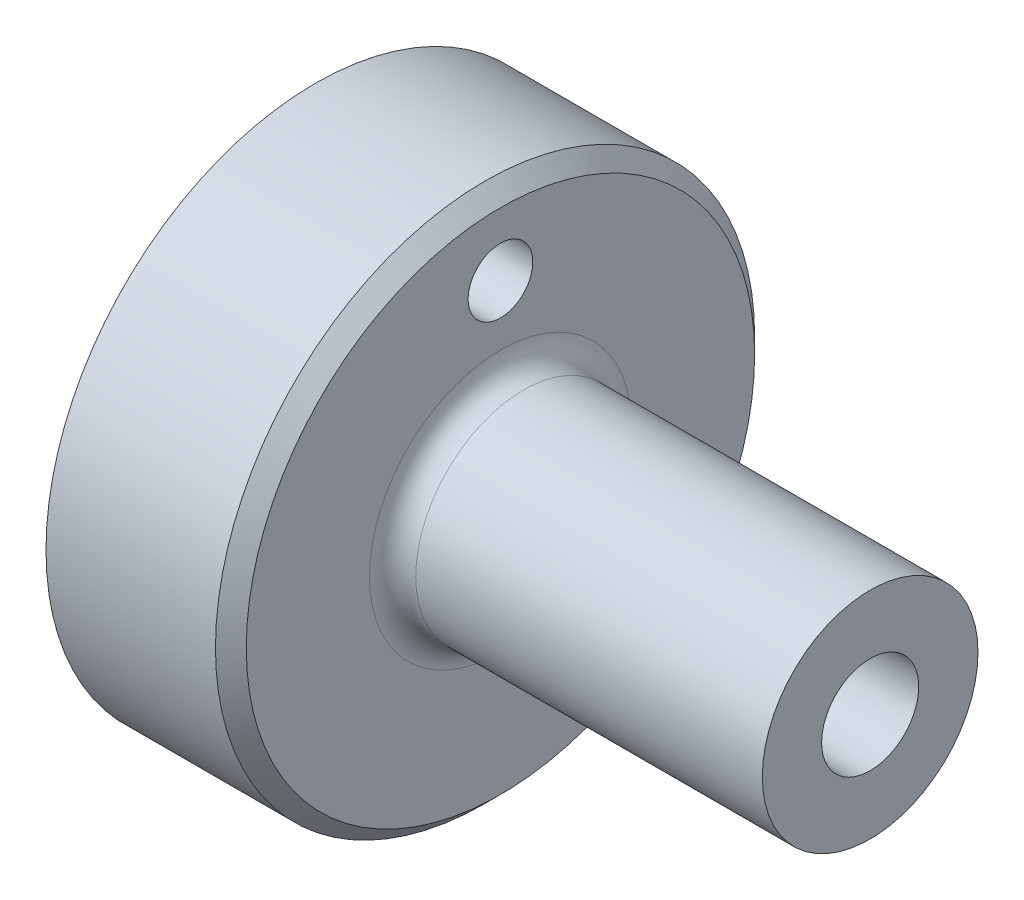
ISO-10303-21;
HEADER;
FILE_DESCRIPTION(('STEP AP214'),'2;1');
FILE_NAME('part.step','',(''),(''),'','','');
FILE_SCHEMA(('AUTOMOTIVE_DESIGN { 1 0 10303 214 1 1 1 1 }'));
ENDSEC;
DATA;
#1=APPLICATION_CONTEXT('core data for automotive mechanical design processes');
#2=APPLICATION_PROTOCOL_DEFINITION('international standard','automotive_design',2000,#1);
#3=PRODUCT_CONTEXT('',#1,'mechanical');
#4=PRODUCT('Part','Part','',(#3));
#5=PRODUCT_RELATED_PRODUCT_CATEGORY('part','',(#4));
#6=PRODUCT_DEFINITION_FORMATION('','',#4);
#7=PRODUCT_DEFINITION_CONTEXT('part definition',#1,'design');
#8=PRODUCT_DEFINITION('design','',#6,#7);
#9=PRODUCT_DEFINITION_SHAPE('','',#8);
#10=(LENGTH_UNIT() NAMED_UNIT(*) SI_UNIT(.MILLI.,.METRE.));
#11=(NAMED_UNIT(*) PLANE_ANGLE_UNIT() SI_UNIT($,.RADIAN.));
#12=(NAMED_UNIT(*) SI_UNIT($,.STERADIAN.) SOLID_ANGLE_UNIT());
#13=UNCERTAINTY_MEASURE_WITH_UNIT(LENGTH_MEASURE(1.E-05),#10,'distance_accuracy_value','');
#14=(GEOMETRIC_REPRESENTATION_CONTEXT(3) GLOBAL_UNCERTAINTY_ASSIGNED_CONTEXT((#13)) GLOBAL_UNIT_ASSIGNED_CONTEXT((#10,
#11,#12)) REPRESENTATION_CONTEXT('',''));
#15=CARTESIAN_POINT('',(0.,0.,0.));
#16=DIRECTION('',(0.,0.,1.));
#17=DIRECTION('',(1.,0.,0.));
#18=AXIS2_PLACEMENT_3D('',#15,#16,#17);
#19=CARTESIAN_POINT('',(13.5,0.,0.));
#20=DIRECTION('',(-1.,0.,0.));
#21=DIRECTION('',(0.,0.,1.));
#22=AXIS2_PLACEMENT_3D('',#19,#20,#21);
#23=TOROIDAL_SURFACE('',#22,8.5,1.5);
#24=CARTESIAN_POINT('',(12.,0.,0.));
#25=DIRECTION('',(-1.,0.,0.));
#26=DIRECTION('',(0.,0.,1.));
#27=AXIS2_PLACEMENT_3D('',#24,#25,#26);
#28=CIRCLE('',#27,8.5);
#29=CARTESIAN_POINT('',(12.,0.,8.5));
#30=VERTEX_POINT('',#29);
#31=EDGE_CURVE('E29',#30,#30,#28,.T.);
#32=ORIENTED_EDGE('',*,*,#31,.F.);
#33=EDGE_LOOP('',(#32));
#34=FACE_BOUND('',#33,.T.);
#35=CARTESIAN_POINT('',(13.5,0.,0.));
#36=DIRECTION('',(-1.,0.,0.));
#37=DIRECTION('',(0.,0.,1.));
#38=AXIS2_PLACEMENT_3D('',#35,#36,#37);
#39=CIRCLE('',#38,7.);
#40=CARTESIAN_POINT('',(13.5,0.,7.));
#41=VERTEX_POINT('',#40);
#42=EDGE_CURVE('E63',#41,#41,#39,.T.);
#43=ORIENTED_EDGE('',*,*,#42,.T.);
#44=EDGE_LOOP('',(#43));
#45=FACE_BOUND('',#44,.T.);
#46=ADVANCED_FACE('F13',(#34,#45),#23,.F.);
#47=CARTESIAN_POINT('',(12.,17.5,0.));
#48=DIRECTION('',(-1.,0.,0.));
#49=DIRECTION('',(0.,0.,1.));
#50=AXIS2_PLACEMENT_3D('',#47,#48,#49);
#51=PLANE('',#50);
#52=CARTESIAN_POINT('',(12.,0.,0.));
#53=DIRECTION('',(-1.,0.,0.));
#54=DIRECTION('',(0.,0.,1.));
#55=AXIS2_PLACEMENT_3D('',#52,#53,#54);
#56=CIRCLE('',#55,16.5);
#57=CARTESIAN_POINT('',(12.,0.,16.5));
#58=VERTEX_POINT('',#57);
#59=EDGE_CURVE('E8',#58,#58,#56,.F.);
#60=ORIENTED_EDGE('',*,*,#59,.T.);
#61=EDGE_LOOP('',(#60));
#62=FACE_BOUND('',#61,.T.);
#63=CARTESIAN_POINT('',(12.,12.4,0.));
#64=DIRECTION('',(-1.,0.,0.));
#65=DIRECTION('',(0.,0.,1.));
#66=AXIS2_PLACEMENT_3D('',#63,#64,#65);
#67=CIRCLE('',#66,2.1);
#68=CARTESIAN_POINT('',(12.,12.4,2.1));
#69=VERTEX_POINT('',#68);
#70=EDGE_CURVE('E39',#69,#69,#67,.T.);
#71=ORIENTED_EDGE('',*,*,#70,.T.);
#72=EDGE_LOOP('',(#71));
#73=FACE_BOUND('',#72,.T.);
#74=ORIENTED_EDGE('',*,*,#31,.T.);
#75=EDGE_LOOP('',(#74));
#76=FACE_BOUND('',#75,.T.);
#77=ADVANCED_FACE('F102',(#62,#73,#76),#51,.F.);
#78=CARTESIAN_POINT('',(0.,0.,0.));
#79=DIRECTION('',(-1.,0.,0.));
#80=DIRECTION('',(0.,0.,1.));
#81=AXIS2_PLACEMENT_3D('',#78,#79,#80);
#82=CYLINDRICAL_SURFACE('',#81,17.5);
#83=CARTESIAN_POINT('',(11.,0.,0.));
#84=DIRECTION('',(-1.,0.,0.));
#85=DIRECTION('',(0.,0.,1.));
#86=AXIS2_PLACEMENT_3D('',#83,#84,#85);
#87=CIRCLE('',#86,17.5);
#88=CARTESIAN_POINT('',(11.,0.,17.5));
#89=VERTEX_POINT('',#88);
#90=EDGE_CURVE('E21',#89,#89,#87,.T.);
#91=ORIENTED_EDGE('',*,*,#90,.T.);
#92=EDGE_LOOP('',(#91));
#93=FACE_BOUND('',#92,.T.);
#94=CARTESIAN_POINT('',(0.,0.,0.));
#95=DIRECTION('',(-1.,0.,0.));
#96=DIRECTION('',(0.,0.,1.));
#97=AXIS2_PLACEMENT_3D('',#94,#95,#96);
#98=CIRCLE('',#97,17.5);
#99=CARTESIAN_POINT('',(0.,0.,17.5));
#100=VERTEX_POINT('',#99);
#101=EDGE_CURVE('E36',#100,#100,#98,.T.);
#102=ORIENTED_EDGE('',*,*,#101,.F.);
#103=EDGE_LOOP('',(#102));
#104=FACE_BOUND('',#103,.T.);
#105=ADVANCED_FACE('F95',(#93,#104),#82,.T.);
#106=CARTESIAN_POINT('',(0.,4.10062261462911,0.));
#107=DIRECTION('',(1.,0.,0.));
#108=DIRECTION('',(0.,0.,-1.));
#109=AXIS2_PLACEMENT_3D('',#106,#107,#108);
#110=PLANE('',#109);
#111=CARTESIAN_POINT('',(0.,12.4,0.));
#112=DIRECTION('',(-1.,0.,0.));
#113=DIRECTION('',(0.,0.,1.));
#114=AXIS2_PLACEMENT_3D('',#111,#112,#113);
#115=CIRCLE('',#114,3.6);
#116=CARTESIAN_POINT('',(0.,12.4,3.6));
#117=VERTEX_POINT('',#116);
#118=EDGE_CURVE('E42',#117,#117,#115,.T.);
#119=ORIENTED_EDGE('',*,*,#118,.F.);
#120=EDGE_LOOP('',(#119));
#121=FACE_BOUND('',#120,.T.);
#122=CARTESIAN_POINT('',(0.,0.,0.));
#123=DIRECTION('',(-1.,0.,0.));
#124=DIRECTION('',(0.,0.,1.));
#125=AXIS2_PLACEMENT_3D('',#122,#123,#124);
#126=CIRCLE('',#125,4.10062261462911);
#127=CARTESIAN_POINT('',(0.,0.,4.10062261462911));
#128=VERTEX_POINT('',#127);
#129=EDGE_CURVE('E48',#128,#128,#126,.T.);
#130=ORIENTED_EDGE('',*,*,#129,.F.);
#131=EDGE_LOOP('',(#130));
#132=FACE_BOUND('',#131,.T.);
#133=ORIENTED_EDGE('',*,*,#101,.T.);
#134=EDGE_LOOP('',(#133));
#135=FACE_BOUND('',#134,.T.);
#136=ADVANCED_FACE('F91',(#121,#132,#135),#110,.F.);
#137=CARTESIAN_POINT('',(0.,0.,0.));
#138=DIRECTION('',(-1.,0.,0.));
#139=DIRECTION('',(0.,0.,1.));
#140=AXIS2_PLACEMENT_3D('',#137,#138,#139);
#141=CONICAL_SURFACE('',#140,4.10062261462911,0.610865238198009);
#142=CARTESIAN_POINT('',(3.,0.,0.));
#143=DIRECTION('',(-1.,0.,0.));
#144=DIRECTION('',(0.,0.,1.));
#145=AXIS2_PLACEMENT_3D('',#142,#143,#144);
#146=CIRCLE('',#145,2.);
#147=CARTESIAN_POINT('',(3.,0.,2.));
#148=VERTEX_POINT('',#147);
#149=EDGE_CURVE('E52',#148,#148,#146,.T.);
#150=ORIENTED_EDGE('',*,*,#149,.F.);
#151=EDGE_LOOP('',(#150));
#152=FACE_BOUND('',#151,.T.);
#153=ORIENTED_EDGE('',*,*,#129,.T.);
#154=EDGE_LOOP('',(#153));
#155=FACE_BOUND('',#154,.T.);
#156=ADVANCED_FACE('F94',(#152,#155),#141,.F.);
#157=CARTESIAN_POINT('',(3.,0.,0.));
#158=DIRECTION('',(1.,0.,0.));
#159=DIRECTION('',(0.,0.,-1.));
#160=AXIS2_PLACEMENT_3D('',#157,#158,#159);
#161=CONICAL_SURFACE('',#160,2.,0.0349065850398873);
#162=CARTESIAN_POINT('',(36.,0.,0.));
#163=DIRECTION('',(-1.,0.,0.));
#164=DIRECTION('',(0.,0.,1.));
#165=AXIS2_PLACEMENT_3D('',#162,#163,#164);
#166=CIRCLE('',#165,3.1523853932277);
#167=CARTESIAN_POINT('',(36.,0.,3.1523853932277));
#168=VERTEX_POINT('',#167);
#169=EDGE_CURVE('E55',#168,#168,#166,.T.);
#170=ORIENTED_EDGE('',*,*,#169,.F.);
#171=EDGE_LOOP('',(#170));
#172=FACE_BOUND('',#171,.T.);
#173=ORIENTED_EDGE('',*,*,#149,.T.);
#174=EDGE_LOOP('',(#173));
#175=FACE_BOUND('',#174,.T.);
#176=ADVANCED_FACE('F123',(#172,#175),#161,.F.);
#177=CARTESIAN_POINT('',(36.,7.,0.));
#178=DIRECTION('',(-1.,0.,0.));
#179=DIRECTION('',(0.,0.,1.));
#180=AXIS2_PLACEMENT_3D('',#177,#178,#179);
#181=PLANE('',#180);
#182=CARTESIAN_POINT('',(36.,0.,0.));
#183=DIRECTION('',(-1.,0.,0.));
#184=DIRECTION('',(0.,0.,1.));
#185=AXIS2_PLACEMENT_3D('',#182,#183,#184);
#186=CIRCLE('',#185,7.);
#187=CARTESIAN_POINT('',(36.,0.,7.));
#188=VERTEX_POINT('',#187);
#189=EDGE_CURVE('E59',#188,#188,#186,.T.);
#190=ORIENTED_EDGE('',*,*,#189,.F.);
#191=EDGE_LOOP('',(#190));
#192=FACE_BOUND('',#191,.T.);
#193=ORIENTED_EDGE('',*,*,#169,.T.);
#194=EDGE_LOOP('',(#193));
#195=FACE_BOUND('',#194,.T.);
#196=ADVANCED_FACE('F117',(#192,#195),#181,.F.);
#197=CARTESIAN_POINT('',(0.,0.,0.));
#198=DIRECTION('',(-1.,0.,0.));
#199=DIRECTION('',(0.,0.,1.));
#200=AXIS2_PLACEMENT_3D('',#197,#198,#199);
#201=CYLINDRICAL_SURFACE('',#200,7.);
#202=ORIENTED_EDGE('',*,*,#42,.F.);
#203=EDGE_LOOP('',(#202));
#204=FACE_BOUND('',#203,.T.);
#205=ORIENTED_EDGE('',*,*,#189,.T.);
#206=EDGE_LOOP('',(#205));
#207=FACE_BOUND('',#206,.T.);
#208=ADVANCED_FACE('F87',(#204,#207),#201,.T.);
#209=CARTESIAN_POINT('',(5.,12.4,0.));
#210=DIRECTION('',(-1.,0.,0.));
#211=DIRECTION('',(0.,0.,1.));
#212=AXIS2_PLACEMENT_3D('',#209,#210,#211);
#213=CYLINDRICAL_SURFACE('',#212,3.6);
#214=CARTESIAN_POINT('',(5.,12.4,0.));
#215=DIRECTION('',(-1.,0.,0.));
#216=DIRECTION('',(0.,0.,1.));
#217=AXIS2_PLACEMENT_3D('',#214,#215,#216);
#218=CIRCLE('',#217,3.6);
#219=CARTESIAN_POINT('',(5.,12.4,3.6));
#220=VERTEX_POINT('',#219);
#221=EDGE_CURVE('E66',#220,#220,#218,.T.);
#222=ORIENTED_EDGE('',*,*,#221,.F.);
#223=EDGE_LOOP('',(#222));
#224=FACE_BOUND('',#223,.T.);
#225=ORIENTED_EDGE('',*,*,#118,.T.);
#226=EDGE_LOOP('',(#225));
#227=FACE_BOUND('',#226,.T.);
#228=ADVANCED_FACE('F81',(#224,#227),#213,.F.);
#229=CARTESIAN_POINT('',(5.,12.4,0.));
#230=DIRECTION('',(-1.,0.,0.));
#231=DIRECTION('',(0.,0.,1.));
#232=AXIS2_PLACEMENT_3D('',#229,#230,#231);
#233=PLANE('',#232);
#234=CARTESIAN_POINT('',(5.,12.4,0.));
#235=DIRECTION('',(-1.,0.,0.));
#236=DIRECTION('',(0.,0.,1.));
#237=AXIS2_PLACEMENT_3D('',#234,#235,#236);
#238=CIRCLE('',#237,2.1);
#239=CARTESIAN_POINT('',(5.,12.4,2.1));
#240=VERTEX_POINT('',#239);
#241=EDGE_CURVE('E43',#240,#240,#238,.T.);
#242=ORIENTED_EDGE('',*,*,#241,.F.);
#243=EDGE_LOOP('',(#242));
#244=FACE_BOUND('',#243,.T.);
#245=ORIENTED_EDGE('',*,*,#221,.T.);
#246=EDGE_LOOP('',(#245));
#247=FACE_BOUND('',#246,.T.);
#248=ADVANCED_FACE('F78',(#244,#247),#233,.T.);
#249=CARTESIAN_POINT('',(36.,12.4,0.));
#250=DIRECTION('',(-1.,0.,0.));
#251=DIRECTION('',(0.,0.,1.));
#252=AXIS2_PLACEMENT_3D('',#249,#250,#251);
#253=CYLINDRICAL_SURFACE('',#252,2.1);
#254=ORIENTED_EDGE('',*,*,#241,.T.);
#255=EDGE_LOOP('',(#254));
#256=FACE_BOUND('',#255,.T.);
#257=ORIENTED_EDGE('',*,*,#70,.F.);
#258=EDGE_LOOP('',(#257));
#259=FACE_BOUND('',#258,.T.);
#260=ADVANCED_FACE('F75',(#256,#259),#253,.F.);
#261=CARTESIAN_POINT('',(11.,0.,0.));
#262=DIRECTION('',(-1.,0.,0.));
#263=DIRECTION('',(0.,0.,1.));
#264=AXIS2_PLACEMENT_3D('',#261,#262,#263);
#265=CONICAL_SURFACE('',#264,17.5,0.78539816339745);
#266=ORIENTED_EDGE('',*,*,#59,.F.);
#267=EDGE_LOOP('',(#266));
#268=FACE_BOUND('',#267,.T.);
#269=ORIENTED_EDGE('',*,*,#90,.F.);
#270=EDGE_LOOP('',(#269));
#271=FACE_BOUND('',#270,.T.);
#272=ADVANCED_FACE('F15',(#268,#271),#265,.T.);
#273=CLOSED_SHELL('',(#46,#77,#105,#136,#156,#176,#196,#208,#228,#248,#260,#272));
#274=MANIFOLD_SOLID_BREP('B1',#273);
#275=ADVANCED_BREP_SHAPE_REPRESENTATION('',(#18,#274),#14);
#276=SHAPE_DEFINITION_REPRESENTATION(#9,#275);
ENDSEC;
END-ISO-10303-21;
